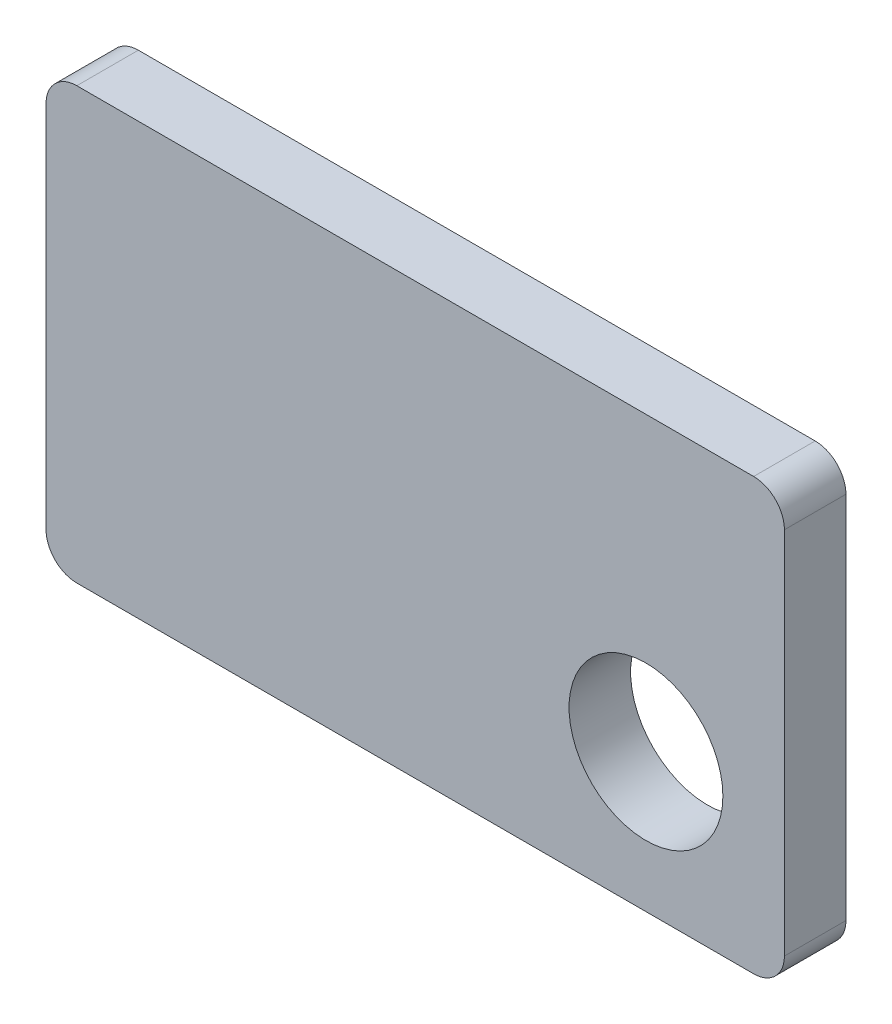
ISO-10303-21;
HEADER;
FILE_DESCRIPTION(('STEP AP214'),'2;1');
FILE_NAME('part.step','',(''),(''),'','','');
FILE_SCHEMA(('AUTOMOTIVE_DESIGN { 1 0 10303 214 1 1 1 1 }'));
ENDSEC;
DATA;
#1=APPLICATION_CONTEXT('core data for automotive mechanical design processes');
#2=APPLICATION_PROTOCOL_DEFINITION('international standard','automotive_design',2000,#1);
#3=PRODUCT_CONTEXT('',#1,'mechanical');
#4=PRODUCT('Part','Part','',(#3));
#5=PRODUCT_RELATED_PRODUCT_CATEGORY('part','',(#4));
#6=PRODUCT_DEFINITION_FORMATION('','',#4);
#7=PRODUCT_DEFINITION_CONTEXT('part definition',#1,'design');
#8=PRODUCT_DEFINITION('design','',#6,#7);
#9=PRODUCT_DEFINITION_SHAPE('','',#8);
#10=(LENGTH_UNIT() NAMED_UNIT(*) SI_UNIT(.MILLI.,.METRE.));
#11=(NAMED_UNIT(*) PLANE_ANGLE_UNIT() SI_UNIT($,.RADIAN.));
#12=(NAMED_UNIT(*) SI_UNIT($,.STERADIAN.) SOLID_ANGLE_UNIT());
#13=UNCERTAINTY_MEASURE_WITH_UNIT(LENGTH_MEASURE(1.E-05),#10,'distance_accuracy_value','');
#14=(GEOMETRIC_REPRESENTATION_CONTEXT(3) GLOBAL_UNCERTAINTY_ASSIGNED_CONTEXT((#13)) GLOBAL_UNIT_ASSIGNED_CONTEXT((#10,
#11,#12)) REPRESENTATION_CONTEXT('',''));
#15=CARTESIAN_POINT('',(0.,0.,0.));
#16=DIRECTION('',(0.,0.,1.));
#17=DIRECTION('',(1.,0.,0.));
#18=AXIS2_PLACEMENT_3D('',#15,#16,#17);
#19=CARTESIAN_POINT('',(6.,3.5,1.));
#20=DIRECTION('',(-1.,0.,0.));
#21=DIRECTION('',(0.,-1.,0.));
#22=AXIS2_PLACEMENT_3D('',#19,#20,#21);
#23=PLANE('',#22);
#24=DIRECTION('',(0.,1.,0.));
#25=VECTOR('',#24,1.);
#26=CARTESIAN_POINT('',(6.,3.5,1.));
#27=LINE('',#26,#25);
#28=CARTESIAN_POINT('',(6.,-3.,1.));
#29=VERTEX_POINT('',#28);
#30=CARTESIAN_POINT('',(6.,3.,1.));
#31=VERTEX_POINT('',#30);
#32=EDGE_CURVE('E127',#29,#31,#27,.T.);
#33=ORIENTED_EDGE('',*,*,#32,.F.);
#34=DIRECTION('',(0.,0.,-1.));
#35=VECTOR('',#34,1.);
#36=CARTESIAN_POINT('',(6.,-3.,1.));
#37=LINE('',#36,#35);
#38=CARTESIAN_POINT('',(6.,-3.,0.));
#39=VERTEX_POINT('',#38);
#40=EDGE_CURVE('E11',#29,#39,#37,.T.);
#41=ORIENTED_EDGE('',*,*,#40,.T.);
#42=DIRECTION('',(0.,1.,0.));
#43=VECTOR('',#42,1.);
#44=CARTESIAN_POINT('',(6.,3.5,0.));
#45=LINE('',#44,#43);
#46=CARTESIAN_POINT('',(6.,3.,0.));
#47=VERTEX_POINT('',#46);
#48=EDGE_CURVE('E158',#39,#47,#45,.T.);
#49=ORIENTED_EDGE('',*,*,#48,.T.);
#50=DIRECTION('',(0.,0.,-1.));
#51=VECTOR('',#50,1.);
#52=CARTESIAN_POINT('',(6.,3.,1.));
#53=LINE('',#52,#51);
#54=EDGE_CURVE('E41',#47,#31,#53,.F.);
#55=ORIENTED_EDGE('',*,*,#54,.T.);
#56=EDGE_LOOP('',(#33,#41,#49,#55));
#57=FACE_BOUND('',#56,.T.);
#58=ADVANCED_FACE('F33',(#57),#23,.F.);
#59=CARTESIAN_POINT('',(-6.,3.5,1.));
#60=DIRECTION('',(0.,-1.,0.));
#61=DIRECTION('',(0.,0.,-1.));
#62=AXIS2_PLACEMENT_3D('',#59,#60,#61);
#63=PLANE('',#62);
#64=DIRECTION('',(-1.,0.,0.));
#65=VECTOR('',#64,1.);
#66=CARTESIAN_POINT('',(-6.,3.5,0.));
#67=LINE('',#66,#65);
#68=CARTESIAN_POINT('',(5.5,3.5,0.));
#69=VERTEX_POINT('',#68);
#70=CARTESIAN_POINT('',(-5.5,3.5,0.));
#71=VERTEX_POINT('',#70);
#72=EDGE_CURVE('E132',#69,#71,#67,.T.);
#73=ORIENTED_EDGE('',*,*,#72,.T.);
#74=DIRECTION('',(0.,0.,-1.));
#75=VECTOR('',#74,1.);
#76=CARTESIAN_POINT('',(-5.5,3.5,1.));
#77=LINE('',#76,#75);
#78=CARTESIAN_POINT('',(-5.5,3.5,1.));
#79=VERTEX_POINT('',#78);
#80=EDGE_CURVE('E48',#71,#79,#77,.F.);
#81=ORIENTED_EDGE('',*,*,#80,.T.);
#82=DIRECTION('',(-1.,0.,0.));
#83=VECTOR('',#82,1.);
#84=CARTESIAN_POINT('',(-6.,3.5,1.));
#85=LINE('',#84,#83);
#86=CARTESIAN_POINT('',(5.5,3.5,1.));
#87=VERTEX_POINT('',#86);
#88=EDGE_CURVE('E130',#87,#79,#85,.T.);
#89=ORIENTED_EDGE('',*,*,#88,.F.);
#90=DIRECTION('',(0.,0.,-1.));
#91=VECTOR('',#90,1.);
#92=CARTESIAN_POINT('',(5.5,3.5,1.));
#93=LINE('',#92,#91);
#94=EDGE_CURVE('E150',#87,#69,#93,.T.);
#95=ORIENTED_EDGE('',*,*,#94,.T.);
#96=EDGE_LOOP('',(#73,#81,#89,#95));
#97=FACE_BOUND('',#96,.T.);
#98=ADVANCED_FACE('F165',(#97),#63,.F.);
#99=CARTESIAN_POINT('',(-6.,3.5,1.));
#100=DIRECTION('',(1.,0.,0.));
#101=DIRECTION('',(0.,1.,0.));
#102=AXIS2_PLACEMENT_3D('',#99,#100,#101);
#103=PLANE('',#102);
#104=DIRECTION('',(0.,-1.,0.));
#105=VECTOR('',#104,1.);
#106=CARTESIAN_POINT('',(-6.,3.5,0.));
#107=LINE('',#106,#105);
#108=CARTESIAN_POINT('',(-6.,3.,0.));
#109=VERTEX_POINT('',#108);
#110=CARTESIAN_POINT('',(-6.,-3.,0.));
#111=VERTEX_POINT('',#110);
#112=EDGE_CURVE('E128',#109,#111,#107,.T.);
#113=ORIENTED_EDGE('',*,*,#112,.T.);
#114=DIRECTION('',(0.,0.,-1.));
#115=VECTOR('',#114,1.);
#116=CARTESIAN_POINT('',(-6.,-3.,1.));
#117=LINE('',#116,#115);
#118=CARTESIAN_POINT('',(-6.,-3.,1.));
#119=VERTEX_POINT('',#118);
#120=EDGE_CURVE('E105',#111,#119,#117,.F.);
#121=ORIENTED_EDGE('',*,*,#120,.T.);
#122=DIRECTION('',(0.,-1.,0.));
#123=VECTOR('',#122,1.);
#124=CARTESIAN_POINT('',(-6.,3.5,1.));
#125=LINE('',#124,#123);
#126=CARTESIAN_POINT('',(-6.,3.,1.));
#127=VERTEX_POINT('',#126);
#128=EDGE_CURVE('E170',#127,#119,#125,.T.);
#129=ORIENTED_EDGE('',*,*,#128,.F.);
#130=DIRECTION('',(0.,0.,-1.));
#131=VECTOR('',#130,1.);
#132=CARTESIAN_POINT('',(-6.,3.,1.));
#133=LINE('',#132,#131);
#134=EDGE_CURVE('E110',#127,#109,#133,.T.);
#135=ORIENTED_EDGE('',*,*,#134,.T.);
#136=EDGE_LOOP('',(#113,#121,#129,#135));
#137=FACE_BOUND('',#136,.T.);
#138=ADVANCED_FACE('F190',(#137),#103,.F.);
#139=CARTESIAN_POINT('',(-6.,-3.5,1.));
#140=DIRECTION('',(0.,1.,0.));
#141=DIRECTION('',(0.,0.,1.));
#142=AXIS2_PLACEMENT_3D('',#139,#140,#141);
#143=PLANE('',#142);
#144=DIRECTION('',(1.,0.,0.));
#145=VECTOR('',#144,1.);
#146=CARTESIAN_POINT('',(-6.,-3.5,1.));
#147=LINE('',#146,#145);
#148=CARTESIAN_POINT('',(-5.5,-3.5,1.));
#149=VERTEX_POINT('',#148);
#150=CARTESIAN_POINT('',(5.5,-3.5,1.));
#151=VERTEX_POINT('',#150);
#152=EDGE_CURVE('E120',#149,#151,#147,.T.);
#153=ORIENTED_EDGE('',*,*,#152,.F.);
#154=DIRECTION('',(0.,0.,-1.));
#155=VECTOR('',#154,1.);
#156=CARTESIAN_POINT('',(-5.5,-3.5,1.));
#157=LINE('',#156,#155);
#158=CARTESIAN_POINT('',(-5.5,-3.5,0.));
#159=VERTEX_POINT('',#158);
#160=EDGE_CURVE('E104',#149,#159,#157,.T.);
#161=ORIENTED_EDGE('',*,*,#160,.T.);
#162=DIRECTION('',(1.,0.,0.));
#163=VECTOR('',#162,1.);
#164=CARTESIAN_POINT('',(-6.,-3.5,0.));
#165=LINE('',#164,#163);
#166=CARTESIAN_POINT('',(5.5,-3.5,0.));
#167=VERTEX_POINT('',#166);
#168=EDGE_CURVE('E117',#159,#167,#165,.T.);
#169=ORIENTED_EDGE('',*,*,#168,.T.);
#170=DIRECTION('',(0.,0.,-1.));
#171=VECTOR('',#170,1.);
#172=CARTESIAN_POINT('',(5.5,-3.5,1.));
#173=LINE('',#172,#171);
#174=EDGE_CURVE('E122',#167,#151,#173,.F.);
#175=ORIENTED_EDGE('',*,*,#174,.T.);
#176=EDGE_LOOP('',(#153,#161,#169,#175));
#177=FACE_BOUND('',#176,.T.);
#178=ADVANCED_FACE('F116',(#177),#143,.F.);
#179=CARTESIAN_POINT('',(0.,0.,1.));
#180=DIRECTION('',(0.,0.,1.));
#181=DIRECTION('',(1.,0.,0.));
#182=AXIS2_PLACEMENT_3D('',#179,#180,#181);
#183=PLANE('',#182);
#184=CARTESIAN_POINT('',(3.75,-1.25,1.));
#185=DIRECTION('',(0.,0.,1.));
#186=DIRECTION('',(1.,0.,0.));
#187=AXIS2_PLACEMENT_3D('',#184,#185,#186);
#188=CIRCLE('',#187,1.25);
#189=CARTESIAN_POINT('',(5.,-1.25,1.));
#190=VERTEX_POINT('',#189);
#191=EDGE_CURVE('E175',#190,#190,#188,.T.);
#192=ORIENTED_EDGE('',*,*,#191,.F.);
#193=EDGE_LOOP('',(#192));
#194=FACE_BOUND('',#193,.T.);
#195=ORIENTED_EDGE('',*,*,#128,.T.);
#196=CARTESIAN_POINT('',(-5.5,-3.,1.));
#197=DIRECTION('',(0.,0.,1.));
#198=DIRECTION('',(1.,0.,0.));
#199=AXIS2_PLACEMENT_3D('',#196,#197,#198);
#200=CIRCLE('',#199,0.5);
#201=EDGE_CURVE('E148',#119,#149,#200,.T.);
#202=ORIENTED_EDGE('',*,*,#201,.T.);
#203=ORIENTED_EDGE('',*,*,#152,.T.);
#204=CARTESIAN_POINT('',(5.5,-3.,1.));
#205=DIRECTION('',(0.,0.,1.));
#206=DIRECTION('',(1.,0.,0.));
#207=AXIS2_PLACEMENT_3D('',#204,#205,#206);
#208=CIRCLE('',#207,0.5);
#209=EDGE_CURVE('E144',#151,#29,#208,.T.);
#210=ORIENTED_EDGE('',*,*,#209,.T.);
#211=ORIENTED_EDGE('',*,*,#32,.T.);
#212=CARTESIAN_POINT('',(5.5,3.,1.));
#213=DIRECTION('',(0.,0.,1.));
#214=DIRECTION('',(1.,0.,0.));
#215=AXIS2_PLACEMENT_3D('',#212,#213,#214);
#216=CIRCLE('',#215,0.5);
#217=EDGE_CURVE('E55',#31,#87,#216,.T.);
#218=ORIENTED_EDGE('',*,*,#217,.T.);
#219=ORIENTED_EDGE('',*,*,#88,.T.);
#220=CARTESIAN_POINT('',(-5.5,3.,1.));
#221=DIRECTION('',(0.,0.,1.));
#222=DIRECTION('',(1.,0.,0.));
#223=AXIS2_PLACEMENT_3D('',#220,#221,#222);
#224=CIRCLE('',#223,0.5);
#225=EDGE_CURVE('E146',#79,#127,#224,.T.);
#226=ORIENTED_EDGE('',*,*,#225,.T.);
#227=EDGE_LOOP('',(#195,#202,#203,#210,#211,#218,#219,#226));
#228=FACE_BOUND('',#227,.T.);
#229=ADVANCED_FACE('F161',(#194,#228),#183,.T.);
#230=CARTESIAN_POINT('',(0.,0.,0.));
#231=DIRECTION('',(0.,0.,1.));
#232=DIRECTION('',(1.,0.,0.));
#233=AXIS2_PLACEMENT_3D('',#230,#231,#232);
#234=PLANE('',#233);
#235=CARTESIAN_POINT('',(3.75,-1.25,0.));
#236=DIRECTION('',(0.,0.,1.));
#237=DIRECTION('',(1.,0.,0.));
#238=AXIS2_PLACEMENT_3D('',#235,#236,#237);
#239=CIRCLE('',#238,1.25);
#240=CARTESIAN_POINT('',(5.,-1.25,0.));
#241=VERTEX_POINT('',#240);
#242=EDGE_CURVE('E166',#241,#241,#239,.F.);
#243=ORIENTED_EDGE('',*,*,#242,.F.);
#244=EDGE_LOOP('',(#243));
#245=FACE_BOUND('',#244,.T.);
#246=ORIENTED_EDGE('',*,*,#168,.F.);
#247=CARTESIAN_POINT('',(-5.5,-3.,0.));
#248=DIRECTION('',(0.,0.,1.));
#249=DIRECTION('',(1.,0.,0.));
#250=AXIS2_PLACEMENT_3D('',#247,#248,#249);
#251=CIRCLE('',#250,0.5);
#252=EDGE_CURVE('E100',#159,#111,#251,.F.);
#253=ORIENTED_EDGE('',*,*,#252,.T.);
#254=ORIENTED_EDGE('',*,*,#112,.F.);
#255=CARTESIAN_POINT('',(-5.5,3.,0.));
#256=DIRECTION('',(0.,0.,1.));
#257=DIRECTION('',(1.,0.,0.));
#258=AXIS2_PLACEMENT_3D('',#255,#256,#257);
#259=CIRCLE('',#258,0.5);
#260=EDGE_CURVE('E111',#109,#71,#259,.F.);
#261=ORIENTED_EDGE('',*,*,#260,.T.);
#262=ORIENTED_EDGE('',*,*,#72,.F.);
#263=CARTESIAN_POINT('',(5.5,3.,0.));
#264=DIRECTION('',(0.,0.,1.));
#265=DIRECTION('',(1.,0.,0.));
#266=AXIS2_PLACEMENT_3D('',#263,#264,#265);
#267=CIRCLE('',#266,0.5);
#268=EDGE_CURVE('E121',#69,#47,#267,.F.);
#269=ORIENTED_EDGE('',*,*,#268,.T.);
#270=ORIENTED_EDGE('',*,*,#48,.F.);
#271=CARTESIAN_POINT('',(5.5,-3.,0.));
#272=DIRECTION('',(0.,0.,1.));
#273=DIRECTION('',(1.,0.,0.));
#274=AXIS2_PLACEMENT_3D('',#271,#272,#273);
#275=CIRCLE('',#274,0.5);
#276=EDGE_CURVE('E126',#39,#167,#275,.F.);
#277=ORIENTED_EDGE('',*,*,#276,.T.);
#278=EDGE_LOOP('',(#246,#253,#254,#261,#262,#269,#270,#277));
#279=FACE_BOUND('',#278,.T.);
#280=ADVANCED_FACE('F124',(#245,#279),#234,.F.);
#281=CARTESIAN_POINT('',(-5.5,-3.,1.));
#282=DIRECTION('',(0.,0.,-1.));
#283=DIRECTION('',(-1.,0.,0.));
#284=AXIS2_PLACEMENT_3D('',#281,#282,#283);
#285=CYLINDRICAL_SURFACE('',#284,0.5);
#286=ORIENTED_EDGE('',*,*,#201,.F.);
#287=ORIENTED_EDGE('',*,*,#120,.F.);
#288=ORIENTED_EDGE('',*,*,#252,.F.);
#289=ORIENTED_EDGE('',*,*,#160,.F.);
#290=EDGE_LOOP('',(#286,#287,#288,#289));
#291=FACE_BOUND('',#290,.T.);
#292=ADVANCED_FACE('F103',(#291),#285,.T.);
#293=CARTESIAN_POINT('',(-5.5,3.,1.));
#294=DIRECTION('',(0.,0.,-1.));
#295=DIRECTION('',(-1.,0.,0.));
#296=AXIS2_PLACEMENT_3D('',#293,#294,#295);
#297=CYLINDRICAL_SURFACE('',#296,0.5);
#298=ORIENTED_EDGE('',*,*,#225,.F.);
#299=ORIENTED_EDGE('',*,*,#80,.F.);
#300=ORIENTED_EDGE('',*,*,#260,.F.);
#301=ORIENTED_EDGE('',*,*,#134,.F.);
#302=EDGE_LOOP('',(#298,#299,#300,#301));
#303=FACE_BOUND('',#302,.T.);
#304=ADVANCED_FACE('F203',(#303),#297,.T.);
#305=CARTESIAN_POINT('',(5.5,-3.,1.));
#306=DIRECTION('',(0.,0.,-1.));
#307=DIRECTION('',(-1.,0.,0.));
#308=AXIS2_PLACEMENT_3D('',#305,#306,#307);
#309=CYLINDRICAL_SURFACE('',#308,0.5);
#310=ORIENTED_EDGE('',*,*,#209,.F.);
#311=ORIENTED_EDGE('',*,*,#174,.F.);
#312=ORIENTED_EDGE('',*,*,#276,.F.);
#313=ORIENTED_EDGE('',*,*,#40,.F.);
#314=EDGE_LOOP('',(#310,#311,#312,#313));
#315=FACE_BOUND('',#314,.T.);
#316=ADVANCED_FACE('F205',(#315),#309,.T.);
#317=CARTESIAN_POINT('',(5.5,3.,1.));
#318=DIRECTION('',(0.,0.,-1.));
#319=DIRECTION('',(-1.,0.,0.));
#320=AXIS2_PLACEMENT_3D('',#317,#318,#319);
#321=CYLINDRICAL_SURFACE('',#320,0.5);
#322=ORIENTED_EDGE('',*,*,#217,.F.);
#323=ORIENTED_EDGE('',*,*,#54,.F.);
#324=ORIENTED_EDGE('',*,*,#268,.F.);
#325=ORIENTED_EDGE('',*,*,#94,.F.);
#326=EDGE_LOOP('',(#322,#323,#324,#325));
#327=FACE_BOUND('',#326,.T.);
#328=ADVANCED_FACE('F35',(#327),#321,.T.);
#329=CARTESIAN_POINT('',(3.75,-1.25,-0.000999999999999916));
#330=DIRECTION('',(0.,0.,1.));
#331=DIRECTION('',(1.,0.,0.));
#332=AXIS2_PLACEMENT_3D('',#329,#330,#331);
#333=CYLINDRICAL_SURFACE('',#332,1.25);
#334=ORIENTED_EDGE('',*,*,#191,.T.);
#335=EDGE_LOOP('',(#334));
#336=FACE_BOUND('',#335,.T.);
#337=ORIENTED_EDGE('',*,*,#242,.T.);
#338=EDGE_LOOP('',(#337));
#339=FACE_BOUND('',#338,.T.);
#340=ADVANCED_FACE('F179',(#336,#339),#333,.F.);
#341=CLOSED_SHELL('',(#58,#98,#138,#178,#229,#280,#292,#304,#316,#328,#340));
#342=MANIFOLD_SOLID_BREP('B2',#341);
#343=ADVANCED_BREP_SHAPE_REPRESENTATION('',(#18,#342),#14);
#344=SHAPE_DEFINITION_REPRESENTATION(#9,#343);
ENDSEC;
END-ISO-10303-21;
